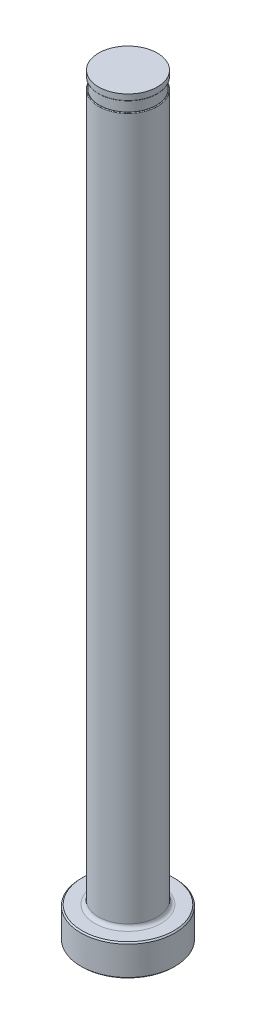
ISO-10303-21;
HEADER;
FILE_DESCRIPTION(('STEP AP214'),'2;1');
FILE_NAME('part.step','',(''),(''),'','','');
FILE_SCHEMA(('AUTOMOTIVE_DESIGN { 1 0 10303 214 1 1 1 1 }'));
ENDSEC;
DATA;
#1=APPLICATION_CONTEXT('core data for automotive mechanical design processes');
#2=APPLICATION_PROTOCOL_DEFINITION('international standard','automotive_design',2000,#1);
#3=PRODUCT_CONTEXT('',#1,'mechanical');
#4=PRODUCT('Part','Part','',(#3));
#5=PRODUCT_RELATED_PRODUCT_CATEGORY('part','',(#4));
#6=PRODUCT_DEFINITION_FORMATION('','',#4);
#7=PRODUCT_DEFINITION_CONTEXT('part definition',#1,'design');
#8=PRODUCT_DEFINITION('design','',#6,#7);
#9=PRODUCT_DEFINITION_SHAPE('','',#8);
#10=(LENGTH_UNIT() NAMED_UNIT(*) SI_UNIT(.MILLI.,.METRE.));
#11=(NAMED_UNIT(*) PLANE_ANGLE_UNIT() SI_UNIT($,.RADIAN.));
#12=(NAMED_UNIT(*) SI_UNIT($,.STERADIAN.) SOLID_ANGLE_UNIT());
#13=UNCERTAINTY_MEASURE_WITH_UNIT(LENGTH_MEASURE(1.E-05),#10,'distance_accuracy_value','');
#14=(GEOMETRIC_REPRESENTATION_CONTEXT(3) GLOBAL_UNCERTAINTY_ASSIGNED_CONTEXT((#13)) GLOBAL_UNIT_ASSIGNED_CONTEXT((#10,
#11,#12)) REPRESENTATION_CONTEXT('',''));
#15=CARTESIAN_POINT('',(0.,0.,0.));
#16=DIRECTION('',(0.,0.,1.));
#17=DIRECTION('',(1.,0.,0.));
#18=AXIS2_PLACEMENT_3D('',#15,#16,#17);
#19=CARTESIAN_POINT('',(-5.95248999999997,151.13,0.));
#20=DIRECTION('',(0.,1.,0.));
#21=DIRECTION('',(0.,0.,1.));
#22=AXIS2_PLACEMENT_3D('',#19,#20,#21);
#23=PLANE('',#22);
#24=CARTESIAN_POINT('',(0.,151.13,0.));
#25=DIRECTION('',(0.,1.,0.));
#26=DIRECTION('',(0.,0.,1.));
#27=AXIS2_PLACEMENT_3D('',#24,#25,#26);
#28=CIRCLE('',#27,5.81278999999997);
#29=CARTESIAN_POINT('',(0.,151.13,5.81278999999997));
#30=VERTEX_POINT('',#29);
#31=EDGE_CURVE('E11',#30,#30,#28,.F.);
#32=ORIENTED_EDGE('',*,*,#31,.T.);
#33=EDGE_LOOP('',(#32));
#34=FACE_BOUND('',#33,.T.);
#35=CARTESIAN_POINT('',(0.,151.13,0.));
#36=DIRECTION('',(0.,1.,0.));
#37=DIRECTION('',(0.,0.,1.));
#38=AXIS2_PLACEMENT_3D('',#35,#36,#37);
#39=CIRCLE('',#38,5.74928999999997);
#40=CARTESIAN_POINT('',(0.,151.13,5.74928999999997));
#41=VERTEX_POINT('',#40);
#42=EDGE_CURVE('E78',#41,#41,#39,.T.);
#43=ORIENTED_EDGE('',*,*,#42,.T.);
#44=EDGE_LOOP('',(#43));
#45=FACE_BOUND('',#44,.T.);
#46=ADVANCED_FACE('F36',(#34,#45),#23,.F.);
#47=CARTESIAN_POINT('',(0.,259.958771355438,0.));
#48=DIRECTION('',(0.,1.,0.));
#49=DIRECTION('',(0.,0.,1.));
#50=AXIS2_PLACEMENT_3D('',#47,#48,#49);
#51=CYLINDRICAL_SURFACE('',#50,5.95248999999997);
#52=DIRECTION('',(0.,1.,0.));
#53=VECTOR('',#52,1.);
#54=CARTESIAN_POINT('',(-5.74928999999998,259.958771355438,-1.5420122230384));
#55=LINE('',#54,#53);
#56=CARTESIAN_POINT('',(-5.74928999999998,148.971,-1.5420122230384));
#57=VERTEX_POINT('',#56);
#58=CARTESIAN_POINT('',(-5.74928999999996,86.614,-1.54201222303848));
#59=VERTEX_POINT('',#58);
#60=EDGE_CURVE('E73',#57,#59,#55,.F.);
#61=ORIENTED_EDGE('',*,*,#60,.F.);
#62=CARTESIAN_POINT('',(0.,148.971,0.));
#63=DIRECTION('',(0.,-1.,0.));
#64=DIRECTION('',(0.,0.,-1.));
#65=AXIS2_PLACEMENT_3D('',#62,#63,#64);
#66=CIRCLE('',#65,5.95248999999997);
#67=CARTESIAN_POINT('',(-5.74928999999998,148.971,1.5420122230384));
#68=VERTEX_POINT('',#67);
#69=EDGE_CURVE('E51',#57,#68,#66,.T.);
#70=ORIENTED_EDGE('',*,*,#69,.T.);
#71=DIRECTION('',(0.,1.,0.));
#72=VECTOR('',#71,1.);
#73=CARTESIAN_POINT('',(-5.74928999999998,259.958771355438,1.5420122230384));
#74=LINE('',#73,#72);
#75=CARTESIAN_POINT('',(-5.74928999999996,86.614,1.54201222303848));
#76=VERTEX_POINT('',#75);
#77=EDGE_CURVE('E84',#76,#68,#74,.T.);
#78=ORIENTED_EDGE('',*,*,#77,.F.);
#79=CARTESIAN_POINT('',(-5.74928999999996,86.614,-1.54201222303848));
#80=CARTESIAN_POINT('',(-5.7492869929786,86.5862208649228,-1.54201697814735));
#81=CARTESIAN_POINT('',(-5.74965505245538,86.5584610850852,-1.54065166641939));
#82=CARTESIAN_POINT('',(-5.75110274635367,86.5032460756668,-1.53524151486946));
#83=CARTESIAN_POINT('',(-5.75218176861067,86.4757906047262,-1.53119898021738));
#84=CARTESIAN_POINT('',(-5.75641075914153,86.3947767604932,-1.51525486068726));
#85=CARTESIAN_POINT('',(-5.76055400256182,86.3419793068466,-1.49953379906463));
#86=CARTESIAN_POINT('',(-5.77092696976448,86.2404513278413,-1.45909687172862));
#87=CARTESIAN_POINT('',(-5.77715061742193,86.191709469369,-1.43440718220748));
#88=CARTESIAN_POINT('',(-5.79098788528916,86.0989780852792,-1.37748193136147));
#89=CARTESIAN_POINT('',(-5.7986047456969,86.0550000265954,-1.34522872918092));
#90=CARTESIAN_POINT('',(-5.8168590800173,85.9601849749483,-1.26430278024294));
#91=CARTESIAN_POINT('',(-5.82772577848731,85.9111387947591,-1.21359133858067));
#92=CARTESIAN_POINT('',(-5.84932001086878,85.8219814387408,-1.10484574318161));
#93=CARTESIAN_POINT('',(-5.86004729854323,85.7818844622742,-1.0468001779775));
#94=CARTESIAN_POINT('',(-5.88390059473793,85.6979339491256,-0.904778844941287));
#95=CARTESIAN_POINT('',(-5.89659263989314,85.6574837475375,-0.818723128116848));
#96=CARTESIAN_POINT('',(-5.91855552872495,85.5905666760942,-0.641010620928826));
#97=CARTESIAN_POINT('',(-5.92782357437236,85.5641112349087,-0.549349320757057));
#98=CARTESIAN_POINT('',(-5.94230780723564,85.5236429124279,-0.360889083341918));
#99=CARTESIAN_POINT('',(-5.94742894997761,85.5099208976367,-0.26402114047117));
#100=CARTESIAN_POINT('',(-5.95288793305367,85.495318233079,-0.0691558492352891));
#101=CARTESIAN_POINT('',(-5.95322242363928,85.4944465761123,0.0288422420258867));
#102=CARTESIAN_POINT('',(-5.94868446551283,85.5065404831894,0.242237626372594));
#103=CARTESIAN_POINT('',(-5.94283113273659,85.5221121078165,0.357477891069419));
#104=CARTESIAN_POINT('',(-5.92492015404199,85.5723022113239,0.583281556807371));
#105=CARTESIAN_POINT('',(-5.91286985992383,85.6068981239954,0.693850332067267));
#106=CARTESIAN_POINT('',(-5.88892429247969,85.6822489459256,0.870563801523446));
#107=CARTESIAN_POINT('',(-5.8782833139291,85.7172292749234,0.939352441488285));
#108=CARTESIAN_POINT('',(-5.85581507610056,85.7974071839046,1.07049428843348));
#109=CARTESIAN_POINT('',(-5.84398982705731,85.8425876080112,1.13285804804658));
#110=CARTESIAN_POINT('',(-5.82307219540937,85.9323208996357,1.23534317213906));
#111=CARTESIAN_POINT('',(-5.81396107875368,85.97474672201,1.27731748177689));
#112=CARTESIAN_POINT('',(-5.79660025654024,86.0659777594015,1.35392068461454));
#113=CARTESIAN_POINT('',(-5.78834968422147,86.1147764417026,1.38855700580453));
#114=CARTESIAN_POINT('',(-5.77487399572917,86.2094137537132,1.4434795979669));
#115=CARTESIAN_POINT('',(-5.76937362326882,86.2543804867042,1.46519744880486));
#116=CARTESIAN_POINT('',(-5.76015985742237,86.3473997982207,1.50101335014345));
#117=CARTESIAN_POINT('',(-5.75644319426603,86.3954465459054,1.51512534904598));
#118=CARTESIAN_POINT('',(-5.75233279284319,86.4722424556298,1.53063311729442));
#119=CARTESIAN_POINT('',(-5.75119737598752,86.500400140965,1.53488770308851));
#120=CARTESIAN_POINT('',(-5.74967384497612,86.5570323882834,1.54058135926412));
#121=CARTESIAN_POINT('',(-5.74928611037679,86.5855071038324,1.54201899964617));
#122=CARTESIAN_POINT('',(-5.74928999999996,86.614,1.54201222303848));
#123=B_SPLINE_CURVE_WITH_KNOTS('',3,(#79,#80,#81,#82,#83,#84,#85,#86,#87,#88,#89,#90,#91,#92,
#93,#94,#95,#96,#97,#98,#99,#100,#101,#102,#103,#104,#105,#106,#107,#108,#109,#110,#111,#112,
#113,#114,#115,#116,#117,#118,#119,#120,#121,#122),.UNSPECIFIED.,.F.,.F.,(4,2,2,2,2,2,2,2,2,2,2,
2,2,2,2,2,2,2,2,2,2,4),(0.,0.0832648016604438,0.166458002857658,0.331100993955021,
0.495267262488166,0.659820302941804,0.872804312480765,1.08612389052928,1.37238232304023,
1.65887416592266,1.95175985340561,2.2448504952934,2.59250114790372,2.93974031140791,
3.17269488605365,3.4052605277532,3.58572381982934,3.76600355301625,3.91610532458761,
4.0659308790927,4.15129340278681,4.23669924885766),.UNSPECIFIED.);
#124=EDGE_CURVE('E81',#59,#76,#123,.T.);
#125=ORIENTED_EDGE('',*,*,#124,.F.);
#126=EDGE_LOOP('',(#61,#70,#78,#125));
#127=FACE_BOUND('',#126,.T.);
#128=CARTESIAN_POINT('',(0.,7.11200000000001,0.));
#129=DIRECTION('',(0.,1.,0.));
#130=DIRECTION('',(0.,0.,1.));
#131=AXIS2_PLACEMENT_3D('',#128,#129,#130);
#132=CIRCLE('',#131,5.95248999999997);
#133=CARTESIAN_POINT('',(0.,7.11200000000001,5.95248999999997));
#134=VERTEX_POINT('',#133);
#135=EDGE_CURVE('E116',#134,#134,#132,.T.);
#136=ORIENTED_EDGE('',*,*,#135,.T.);
#137=EDGE_LOOP('',(#136));
#138=FACE_BOUND('',#137,.T.);
#139=ADVANCED_FACE('F82',(#127,#138),#51,.T.);
#140=CARTESIAN_POINT('',(0.,0.,0.));
#141=DIRECTION('',(0.,-1.,0.));
#142=DIRECTION('',(0.,0.,-1.));
#143=AXIS2_PLACEMENT_3D('',#140,#141,#142);
#144=PLANE('',#143);
#145=CARTESIAN_POINT('',(0.,0.,0.));
#146=DIRECTION('',(0.,-1.,0.));
#147=DIRECTION('',(0.,0.,-1.));
#148=AXIS2_PLACEMENT_3D('',#145,#146,#147);
#149=CIRCLE('',#148,9.271);
#150=CARTESIAN_POINT('',(0.,0.,-9.271));
#151=VERTEX_POINT('',#150);
#152=EDGE_CURVE('E113',#151,#151,#149,.T.);
#153=ORIENTED_EDGE('',*,*,#152,.T.);
#154=EDGE_LOOP('',(#153));
#155=FACE_BOUND('',#154,.T.);
#156=ADVANCED_FACE('F192',(#155),#144,.T.);
#157=CARTESIAN_POINT('',(0.,259.958771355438,0.));
#158=DIRECTION('',(0.,1.,0.));
#159=DIRECTION('',(0.,0.,1.));
#160=AXIS2_PLACEMENT_3D('',#157,#158,#159);
#161=CYLINDRICAL_SURFACE('',#160,9.52499999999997);
#162=CARTESIAN_POINT('',(0.,6.09600000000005,0.));
#163=DIRECTION('',(0.,1.,0.));
#164=DIRECTION('',(0.,0.,1.));
#165=AXIS2_PLACEMENT_3D('',#162,#163,#164);
#166=CIRCLE('',#165,9.52499999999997);
#167=CARTESIAN_POINT('',(0.,6.09600000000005,9.52499999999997));
#168=VERTEX_POINT('',#167);
#169=EDGE_CURVE('E110',#168,#168,#166,.F.);
#170=ORIENTED_EDGE('',*,*,#169,.T.);
#171=EDGE_LOOP('',(#170));
#172=FACE_BOUND('',#171,.T.);
#173=CARTESIAN_POINT('',(0.,0.253999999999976,0.));
#174=DIRECTION('',(0.,-1.,0.));
#175=DIRECTION('',(0.,0.,-1.));
#176=AXIS2_PLACEMENT_3D('',#173,#174,#175);
#177=CIRCLE('',#176,9.52499999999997);
#178=CARTESIAN_POINT('',(0.,0.253999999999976,-9.52499999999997));
#179=VERTEX_POINT('',#178);
#180=EDGE_CURVE('E107',#179,#179,#177,.F.);
#181=ORIENTED_EDGE('',*,*,#180,.T.);
#182=EDGE_LOOP('',(#181));
#183=FACE_BOUND('',#182,.T.);
#184=ADVANCED_FACE('F195',(#172,#183),#161,.T.);
#185=CARTESIAN_POINT('',(-9.52499999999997,6.35,0.));
#186=DIRECTION('',(0.,1.,0.));
#187=DIRECTION('',(0.,0.,1.));
#188=AXIS2_PLACEMENT_3D('',#185,#186,#187);
#189=PLANE('',#188);
#190=CARTESIAN_POINT('',(0.,6.35,0.));
#191=DIRECTION('',(0.,1.,0.));
#192=DIRECTION('',(0.,0.,1.));
#193=AXIS2_PLACEMENT_3D('',#190,#191,#192);
#194=CIRCLE('',#193,6.71448999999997);
#195=CARTESIAN_POINT('',(0.,6.35,6.71448999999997));
#196=VERTEX_POINT('',#195);
#197=EDGE_CURVE('E87',#196,#196,#194,.F.);
#198=ORIENTED_EDGE('',*,*,#197,.T.);
#199=EDGE_LOOP('',(#198));
#200=FACE_BOUND('',#199,.T.);
#201=CARTESIAN_POINT('',(0.,6.35,0.));
#202=DIRECTION('',(0.,1.,0.));
#203=DIRECTION('',(0.,0.,1.));
#204=AXIS2_PLACEMENT_3D('',#201,#202,#203);
#205=CIRCLE('',#204,9.27100000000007);
#206=CARTESIAN_POINT('',(0.,6.35,9.27100000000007));
#207=VERTEX_POINT('',#206);
#208=EDGE_CURVE('E104',#207,#207,#205,.T.);
#209=ORIENTED_EDGE('',*,*,#208,.T.);
#210=EDGE_LOOP('',(#209));
#211=FACE_BOUND('',#210,.T.);
#212=ADVANCED_FACE('F190',(#200,#211),#189,.T.);
#213=CARTESIAN_POINT('',(0.,6.35000000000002,0.));
#214=DIRECTION('',(0.,-1.,0.));
#215=DIRECTION('',(0.,0.,-1.));
#216=AXIS2_PLACEMENT_3D('',#213,#214,#215);
#217=CONICAL_SURFACE('',#216,9.27100000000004,0.785398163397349);
#218=ORIENTED_EDGE('',*,*,#169,.F.);
#219=EDGE_LOOP('',(#218));
#220=FACE_BOUND('',#219,.T.);
#221=ORIENTED_EDGE('',*,*,#208,.F.);
#222=EDGE_LOOP('',(#221));
#223=FACE_BOUND('',#222,.T.);
#224=ADVANCED_FACE('F186',(#220,#223),#217,.T.);
#225=CARTESIAN_POINT('',(0.,0.253999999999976,0.));
#226=DIRECTION('',(0.,1.,0.));
#227=DIRECTION('',(0.,0.,1.));
#228=AXIS2_PLACEMENT_3D('',#225,#226,#227);
#229=CONICAL_SURFACE('',#228,9.52499999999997,0.785398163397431);
#230=ORIENTED_EDGE('',*,*,#152,.F.);
#231=EDGE_LOOP('',(#230));
#232=FACE_BOUND('',#231,.T.);
#233=ORIENTED_EDGE('',*,*,#180,.F.);
#234=EDGE_LOOP('',(#233));
#235=FACE_BOUND('',#234,.T.);
#236=ADVANCED_FACE('F182',(#232,#235),#229,.T.);
#237=CARTESIAN_POINT('',(0.,7.11200000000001,0.));
#238=DIRECTION('',(0.,1.,0.));
#239=DIRECTION('',(0.,0.,1.));
#240=AXIS2_PLACEMENT_3D('',#237,#238,#239);
#241=TOROIDAL_SURFACE('',#240,6.71448999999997,0.762);
#242=ORIENTED_EDGE('',*,*,#197,.F.);
#243=EDGE_LOOP('',(#242));
#244=FACE_BOUND('',#243,.T.);
#245=ORIENTED_EDGE('',*,*,#135,.F.);
#246=EDGE_LOOP('',(#245));
#247=FACE_BOUND('',#246,.T.);
#248=ADVANCED_FACE('F147',(#244,#247),#241,.F.);
#249=CARTESIAN_POINT('',(-5.95248999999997,149.098,0.));
#250=DIRECTION('',(0.,-1.,0.));
#251=DIRECTION('',(0.,0.,-1.));
#252=AXIS2_PLACEMENT_3D('',#249,#250,#251);
#253=PLANE('',#252);
#254=DIRECTION('',(0.,0.,1.));
#255=VECTOR('',#254,1.);
#256=CARTESIAN_POINT('',(-5.74928999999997,149.098,0.));
#257=LINE('',#256,#255);
#258=CARTESIAN_POINT('',(-5.74928999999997,149.098,0.));
#259=VERTEX_POINT('',#258);
#260=CARTESIAN_POINT('',(-5.74928999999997,149.098,0.939147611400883));
#261=VERTEX_POINT('',#260);
#262=EDGE_CURVE('E90',#259,#261,#257,.T.);
#263=ORIENTED_EDGE('',*,*,#262,.T.);
#264=CARTESIAN_POINT('',(0.,149.098,0.));
#265=DIRECTION('',(0.,-1.,0.));
#266=DIRECTION('',(0.,0.,-1.));
#267=AXIS2_PLACEMENT_3D('',#264,#265,#266);
#268=CIRCLE('',#267,5.82548999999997);
#269=CARTESIAN_POINT('',(-5.74928999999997,149.098,-0.939147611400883));
#270=VERTEX_POINT('',#269);
#271=EDGE_CURVE('E86',#261,#270,#268,.F.);
#272=ORIENTED_EDGE('',*,*,#271,.T.);
#273=EDGE_CURVE('E79',#270,#259,#257,.T.);
#274=ORIENTED_EDGE('',*,*,#273,.T.);
#275=CARTESIAN_POINT('',(0.,149.098,0.));
#276=DIRECTION('',(0.,1.,0.));
#277=DIRECTION('',(0.,0.,1.));
#278=AXIS2_PLACEMENT_3D('',#275,#276,#277);
#279=CIRCLE('',#278,5.74928999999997);
#280=EDGE_CURVE('E101',#259,#259,#279,.T.);
#281=ORIENTED_EDGE('',*,*,#280,.F.);
#282=EDGE_LOOP('',(#263,#272,#274,#281));
#283=FACE_BOUND('',#282,.T.);
#284=ADVANCED_FACE('F144',(#283),#253,.F.);
#285=CARTESIAN_POINT('',(0.,153.448281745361,0.));
#286=DIRECTION('',(0.,1.,0.));
#287=DIRECTION('',(0.,0.,1.));
#288=AXIS2_PLACEMENT_3D('',#285,#286,#287);
#289=CYLINDRICAL_SURFACE('',#288,5.74928999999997);
#290=ORIENTED_EDGE('',*,*,#42,.F.);
#291=EDGE_LOOP('',(#290));
#292=FACE_BOUND('',#291,.T.);
#293=ORIENTED_EDGE('',*,*,#280,.T.);
#294=EDGE_LOOP('',(#293));
#295=FACE_BOUND('',#294,.T.);
#296=ADVANCED_FACE('F141',(#292,#295),#289,.T.);
#297=CARTESIAN_POINT('',(-5.74928999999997,150.114,-9.52499999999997));
#298=DIRECTION('',(1.,0.,0.));
#299=DIRECTION('',(0.,1.,0.));
#300=AXIS2_PLACEMENT_3D('',#297,#298,#299);
#301=PLANE('',#300);
#302=ORIENTED_EDGE('',*,*,#273,.F.);
#303=CARTESIAN_POINT('',(-5.74928999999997,149.098,-0.939147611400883));
#304=CARTESIAN_POINT('',(-5.74928999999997,149.097999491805,-0.960313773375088));
#305=CARTESIAN_POINT('',(-5.74928999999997,149.097863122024,-0.981479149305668));
#306=CARTESIAN_POINT('',(-5.74928999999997,149.097255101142,-1.02381131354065));
#307=CARTESIAN_POINT('',(-5.74928999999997,149.096783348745,-1.0449781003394));
#308=CARTESIAN_POINT('',(-5.74928999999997,149.094768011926,-1.10851964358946));
#309=CARTESIAN_POINT('',(-5.74928999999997,149.092624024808,-1.15088175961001));
#310=CARTESIAN_POINT('',(-5.74928999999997,149.087688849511,-1.21286687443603));
#311=CARTESIAN_POINT('',(-5.74928999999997,149.085853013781,-1.23256518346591));
#312=CARTESIAN_POINT('',(-5.74928999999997,149.081501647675,-1.27188290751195));
#313=CARTESIAN_POINT('',(-5.74928999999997,149.078986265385,-1.29150233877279));
#314=CARTESIAN_POINT('',(-5.74928999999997,149.071966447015,-1.33801228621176));
#315=CARTESIAN_POINT('',(-5.74928999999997,149.067069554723,-1.36484781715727));
#316=CARTESIAN_POINT('',(-5.74928999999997,149.056495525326,-1.40986464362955));
#317=CARTESIAN_POINT('',(-5.74928999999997,149.051508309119,-1.4281964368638));
#318=CARTESIAN_POINT('',(-5.74928999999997,149.042514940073,-1.45484549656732));
#319=CARTESIAN_POINT('',(-5.74928999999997,149.039335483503,-1.46343850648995));
#320=CARTESIAN_POINT('',(-5.74928999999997,149.03227591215,-1.48034059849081));
#321=CARTESIAN_POINT('',(-5.74928999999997,149.028396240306,-1.48864985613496));
#322=CARTESIAN_POINT('',(-5.74928999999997,149.021506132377,-1.50120056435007));
#323=CARTESIAN_POINT('',(-5.74928999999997,149.018853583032,-1.5056368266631));
#324=CARTESIAN_POINT('',(-5.74928999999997,149.013101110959,-1.51421595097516));
#325=CARTESIAN_POINT('',(-5.74928999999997,149.01000162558,-1.51835909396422));
#326=CARTESIAN_POINT('',(-5.74928999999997,149.004471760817,-1.52466635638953));
#327=CARTESIAN_POINT('',(-5.74928999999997,149.00222570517,-1.52699040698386));
#328=CARTESIAN_POINT('',(-5.74928999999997,148.997445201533,-1.53132640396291));
#329=CARTESIAN_POINT('',(-5.74928999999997,148.994911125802,-1.53333874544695));
#330=CARTESIAN_POINT('',(-5.74928999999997,148.990334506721,-1.53634422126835));
#331=CARTESIAN_POINT('',(-5.74928999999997,148.988374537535,-1.53746164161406));
#332=CARTESIAN_POINT('',(-5.74928999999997,148.984307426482,-1.53937528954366));
#333=CARTESIAN_POINT('',(-5.74928999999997,148.982200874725,-1.54017272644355));
#334=CARTESIAN_POINT('',(-5.74928999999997,148.9785728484,-1.54117250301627));
#335=CARTESIAN_POINT('',(-5.74928999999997,148.977081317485,-1.54148377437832));
#336=CARTESIAN_POINT('',(-5.74928999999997,148.974060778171,-1.54190531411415));
#337=CARTESIAN_POINT('',(-5.74928999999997,148.972531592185,-1.5420142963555));
#338=CARTESIAN_POINT('',(-5.74928999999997,148.971000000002,-1.54201222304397));
#339=B_SPLINE_CURVE_WITH_KNOTS('',3,(#303,#304,#305,#306,#307,#308,#309,#310,#311,#312,#313,
#314,#315,#316,#317,#318,#319,#320,#321,#322,#323,#324,#325,#326,#327,#328,#329,#330,#331,#332,
#333,#334,#335,#336,#337,#338),.UNSPECIFIED.,.F.,.F.,(4,2,2,2,2,2,2,2,2,2,2,2,2,2,2,2,2,4),(0.,
0.0634959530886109,0.127011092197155,0.254202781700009,0.313544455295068,0.372873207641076,
0.454629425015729,0.511527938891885,0.538997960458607,0.566450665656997,0.581940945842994,
0.597416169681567,0.607094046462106,0.616759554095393,0.62350701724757,0.630228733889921,
0.634786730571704,0.639373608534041),.UNSPECIFIED.);
#340=EDGE_CURVE('E59',#270,#57,#339,.T.);
#341=ORIENTED_EDGE('',*,*,#340,.T.);
#342=ORIENTED_EDGE('',*,*,#60,.T.);
#343=DIRECTION('',(0.,0.,1.));
#344=VECTOR('',#343,1.);
#345=CARTESIAN_POINT('',(-5.74928999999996,86.614,-9.52499999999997));
#346=LINE('',#345,#344);
#347=EDGE_CURVE('E77',#59,#76,#346,.T.);
#348=ORIENTED_EDGE('',*,*,#347,.T.);
#349=ORIENTED_EDGE('',*,*,#77,.T.);
#350=CARTESIAN_POINT('',(-5.74928999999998,148.971,1.5420122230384));
#351=CARTESIAN_POINT('',(-5.74928999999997,148.973261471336,1.54202038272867));
#352=CARTESIAN_POINT('',(-5.74928999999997,148.975510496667,1.54177946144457));
#353=CARTESIAN_POINT('',(-5.74928999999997,148.979887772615,1.54087970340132));
#354=CARTESIAN_POINT('',(-5.74928999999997,148.982017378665,1.54022760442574));
#355=CARTESIAN_POINT('',(-5.74928999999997,148.986617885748,1.53838865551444));
#356=CARTESIAN_POINT('',(-5.74928999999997,148.989052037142,1.53711237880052));
#357=CARTESIAN_POINT('',(-5.74928999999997,148.993698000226,1.53418694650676));
#358=CARTESIAN_POINT('',(-5.74928999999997,148.995908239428,1.53253538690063));
#359=CARTESIAN_POINT('',(-5.74928999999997,149.001730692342,1.52761233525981));
#360=CARTESIAN_POINT('',(-5.74928999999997,149.005112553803,1.5240724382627));
#361=CARTESIAN_POINT('',(-5.74928999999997,149.011360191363,1.51657566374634));
#362=CARTESIAN_POINT('',(-5.74928999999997,149.01422496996,1.5126180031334));
#363=CARTESIAN_POINT('',(-5.74928999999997,149.021008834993,1.50226117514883));
#364=CARTESIAN_POINT('',(-5.74928999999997,149.024667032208,1.49569302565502));
#365=CARTESIAN_POINT('',(-5.74928999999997,149.031372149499,1.48224724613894));
#366=CARTESIAN_POINT('',(-5.74928999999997,149.034417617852,1.47536892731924));
#367=CARTESIAN_POINT('',(-5.74928999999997,149.042912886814,1.45440029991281));
#368=CARTESIAN_POINT('',(-5.74928999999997,149.047686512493,1.44003865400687));
#369=CARTESIAN_POINT('',(-5.74928999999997,149.056114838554,1.41106200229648));
#370=CARTESIAN_POINT('',(-5.74928999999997,149.059772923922,1.39644790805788));
#371=CARTESIAN_POINT('',(-5.74928999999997,149.066305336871,1.36704254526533));
#372=CARTESIAN_POINT('',(-5.74928999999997,149.069179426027,1.35225122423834));
#373=CARTESIAN_POINT('',(-5.74928999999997,149.076936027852,1.30765909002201));
#374=CARTESIAN_POINT('',(-5.74928999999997,149.080935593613,1.27770752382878));
#375=CARTESIAN_POINT('',(-5.74928999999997,149.087413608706,1.21764271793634));
#376=CARTESIAN_POINT('',(-5.74928999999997,149.089891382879,1.18752941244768));
#377=CARTESIAN_POINT('',(-5.74928999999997,149.09374393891,1.12726865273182));
#378=CARTESIAN_POINT('',(-5.74928999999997,149.095119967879,1.09712127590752));
#379=CARTESIAN_POINT('',(-5.74928999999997,149.096769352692,1.04562383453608));
#380=CARTESIAN_POINT('',(-5.74928999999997,149.097247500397,1.02427949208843));
#381=CARTESIAN_POINT('',(-5.74928999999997,149.097861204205,0.98167241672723));
#382=CARTESIAN_POINT('',(-5.74928999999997,149.097998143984,0.960409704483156));
#383=CARTESIAN_POINT('',(-5.74928999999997,149.098,0.939147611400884));
#384=B_SPLINE_CURVE_WITH_KNOTS('',3,(#350,#351,#352,#353,#354,#355,#356,#357,#358,#359,#360,
#361,#362,#363,#364,#365,#366,#367,#368,#369,#370,#371,#372,#373,#374,#375,#376,#377,#378,#379,
#380,#381,#382,#383),.UNSPECIFIED.,.F.,.F.,(4,2,2,2,2,2,2,2,2,2,2,2,2,2,2,2,4),(0.,
0.00675172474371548,0.0133955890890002,0.0215941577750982,0.0298468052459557,0.0444516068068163,
0.0590842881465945,0.0815815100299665,0.104131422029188,0.149443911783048,0.19461750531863,
0.239804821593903,0.330387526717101,0.421010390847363,0.51153052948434,0.57557722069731,
0.639363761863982),.UNSPECIFIED.);
#385=EDGE_CURVE('E172',#68,#261,#384,.T.);
#386=ORIENTED_EDGE('',*,*,#385,.T.);
#387=ORIENTED_EDGE('',*,*,#262,.F.);
#388=EDGE_LOOP('',(#302,#341,#342,#348,#349,#386,#387));
#389=FACE_BOUND('',#388,.T.);
#390=ADVANCED_FACE('F75',(#389),#301,.F.);
#391=CARTESIAN_POINT('',(-8.92428999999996,86.614,-9.52499999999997));
#392=DIRECTION('',(0.,0.,1.));
#393=DIRECTION('',(1.,0.,0.));
#394=AXIS2_PLACEMENT_3D('',#391,#392,#393);
#395=CYLINDRICAL_SURFACE('',#394,3.175);
#396=ORIENTED_EDGE('',*,*,#347,.F.);
#397=ORIENTED_EDGE('',*,*,#124,.T.);
#398=EDGE_LOOP('',(#396,#397));
#399=FACE_BOUND('',#398,.T.);
#400=ADVANCED_FACE('F89',(#399),#395,.F.);
#401=CARTESIAN_POINT('',(0.,152.687735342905,0.));
#402=DIRECTION('',(0.,1.,0.));
#403=DIRECTION('',(0.,0.,1.));
#404=AXIS2_PLACEMENT_3D('',#401,#402,#403);
#405=CYLINDRICAL_SURFACE('',#404,5.93978999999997);
#406=CARTESIAN_POINT('',(0.,151.257,0.));
#407=DIRECTION('',(0.,1.,0.));
#408=DIRECTION('',(0.,0.,1.));
#409=AXIS2_PLACEMENT_3D('',#406,#407,#408);
#410=CIRCLE('',#409,5.93978999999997);
#411=CARTESIAN_POINT('',(0.,151.257,5.93978999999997));
#412=VERTEX_POINT('',#411);
#413=EDGE_CURVE('E44',#412,#412,#410,.T.);
#414=ORIENTED_EDGE('',*,*,#413,.T.);
#415=EDGE_LOOP('',(#414));
#416=FACE_BOUND('',#415,.T.);
#417=CARTESIAN_POINT('',(0.,152.4,0.));
#418=DIRECTION('',(0.,1.,0.));
#419=DIRECTION('',(0.,0.,1.));
#420=AXIS2_PLACEMENT_3D('',#417,#418,#419);
#421=CIRCLE('',#420,5.93978999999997);
#422=CARTESIAN_POINT('',(0.,152.4,5.93978999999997));
#423=VERTEX_POINT('',#422);
#424=EDGE_CURVE('E91',#423,#423,#421,.T.);
#425=ORIENTED_EDGE('',*,*,#424,.F.);
#426=EDGE_LOOP('',(#425));
#427=FACE_BOUND('',#426,.T.);
#428=ADVANCED_FACE('F135',(#416,#427),#405,.T.);
#429=CARTESIAN_POINT('',(-5.95248999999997,152.4,0.));
#430=DIRECTION('',(0.,1.,0.));
#431=DIRECTION('',(0.,0.,1.));
#432=AXIS2_PLACEMENT_3D('',#429,#430,#431);
#433=PLANE('',#432);
#434=ORIENTED_EDGE('',*,*,#424,.T.);
#435=EDGE_LOOP('',(#434));
#436=FACE_BOUND('',#435,.T.);
#437=ADVANCED_FACE('F149',(#436),#433,.T.);
#438=CARTESIAN_POINT('',(0.,148.971,0.));
#439=DIRECTION('',(0.,-1.,0.));
#440=DIRECTION('',(0.,0.,-1.));
#441=AXIS2_PLACEMENT_3D('',#438,#439,#440);
#442=TOROIDAL_SURFACE('',#441,5.82548999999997,0.127);
#443=ORIENTED_EDGE('',*,*,#385,.F.);
#444=ORIENTED_EDGE('',*,*,#69,.F.);
#445=ORIENTED_EDGE('',*,*,#340,.F.);
#446=ORIENTED_EDGE('',*,*,#271,.F.);
#447=EDGE_LOOP('',(#443,#444,#445,#446));
#448=FACE_BOUND('',#447,.T.);
#449=ADVANCED_FACE('F151',(#448),#442,.T.);
#450=CARTESIAN_POINT('',(0.,151.257,0.));
#451=DIRECTION('',(0.,1.,0.));
#452=DIRECTION('',(0.,0.,1.));
#453=AXIS2_PLACEMENT_3D('',#450,#451,#452);
#454=TOROIDAL_SURFACE('',#453,5.81278999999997,0.127);
#455=ORIENTED_EDGE('',*,*,#31,.F.);
#456=EDGE_LOOP('',(#455));
#457=FACE_BOUND('',#456,.T.);
#458=ORIENTED_EDGE('',*,*,#413,.F.);
#459=EDGE_LOOP('',(#458));
#460=FACE_BOUND('',#459,.T.);
#461=ADVANCED_FACE('F38',(#457,#460),#454,.T.);
#462=CLOSED_SHELL('',(#46,#139,#156,#184,#212,#224,#236,#248,#284,#296,#390,#400,#428,#437,#449,#461));
#463=MANIFOLD_SOLID_BREP('B2',#462);
#464=ADVANCED_BREP_SHAPE_REPRESENTATION('',(#18,#463),#14);
#465=SHAPE_DEFINITION_REPRESENTATION(#9,#464);
ENDSEC;
END-ISO-10303-21;
